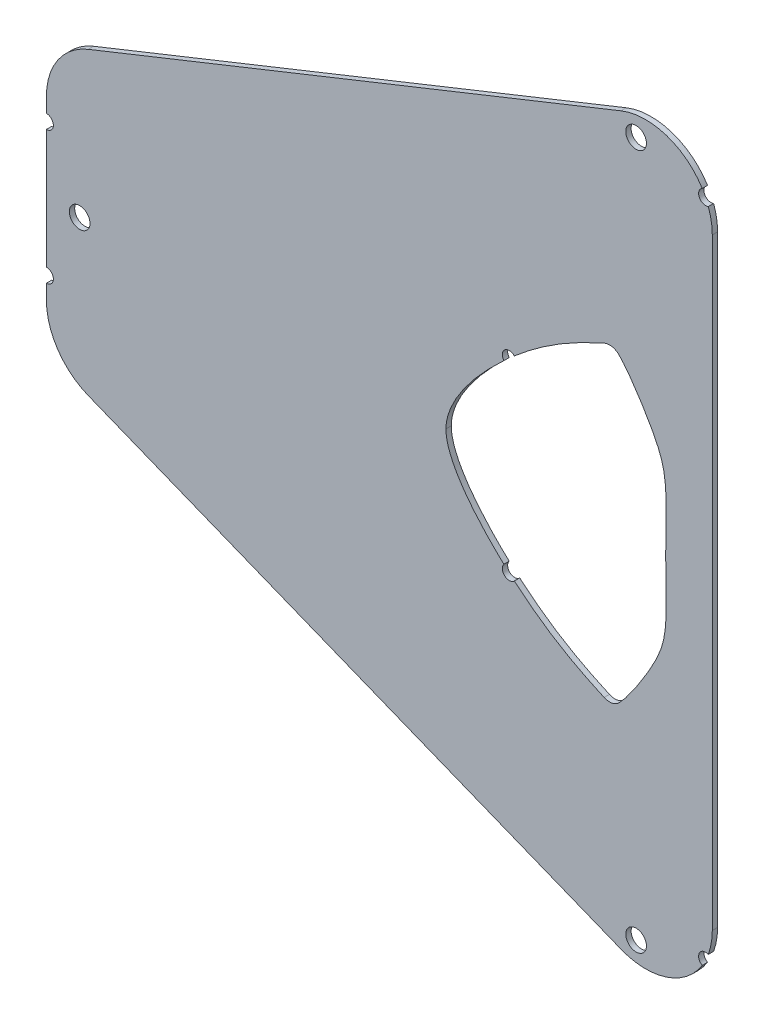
from build123d import *

# Parameters (mm, degrees)
ESQUISSE1_R      = 1.55
EXTRUSION1_DEPTH = 0.8


with BuildPart() as part:
    # Esquisse1 → Extrusion1 (new body)
    with BuildSketch(Plane.XY):
        with BuildLine():
            Line((0, 13.229670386), (0, 11.05))
            ThreePointArc((0, 11.05), (1.05, 10), (0, 8.95))
            Line((0, 8.95), (0, -8.95))
            ThreePointArc((0, -8.95), (1.05, -10), (0, -11.05))
            Line((0, -11.05), (0, -13.229670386))
            ThreePointArc((0, -13.229670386), (1.719327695, -18.835958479), (6.286093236, -22.514437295))
            Line((6.286093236, -22.514437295), (86.286093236, -54.514437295))
            ThreePointArc((86.286093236, -54.514437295), (93.113139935, -54.732741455), (98.487713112, -50.517271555))
            ThreePointArc((98.487713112, -50.517271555), (98.050844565, -49.139453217), (99.403827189, -48.630851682))
            ThreePointArc((99.403827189, -48.630851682), (99.849829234, -46.956188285), (100, -45.229670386))
            Line((100, -45.229670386), (100, -33.256005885))
            Line((100, -33.256005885), (100, 33.256005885))
            Line((100, 33.256005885), (100, 45.229670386))
            ThreePointArc((100, 45.229670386), (99.849829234, 46.956188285), (99.403827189, 48.630851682))
            ThreePointArc((99.403827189, 48.630851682), (98.050844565, 49.139453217), (98.487713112, 50.517271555))
            ThreePointArc((98.487713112, 50.517271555), (93.113139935, 54.732741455), (86.286093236, 54.514437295))
            Line((86.286093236, 54.514437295), (6.286093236, 22.514437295))
            ThreePointArc((6.286093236, 22.514437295), (1.719327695, 18.835958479), (0, 13.229670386))
        make_face()
        with Locations((5, 0)):
            Circle(ESQUISSE1_R, mode=Mode.SUBTRACT)
        with Locations((88.559040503, 52.192517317)):
            Circle(ESQUISSE1_R, mode=Mode.SUBTRACT)
        with Locations(Location((88.559040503, -52.192517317, 0), (0, 0, 180))):
            Circle(ESQUISSE1_R, mode=Mode.SUBTRACT)
        with BuildLine():
            ThreePointArc((70.275371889, 14.632479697), (68.822127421, 14.688991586), (68.706420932, 13.239258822))
            add(Edge.make_bspline(
                [(68.706420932, 13.239258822), (64.219328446, 9.108559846), (60.01836992, 3.928466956), (60, 0)],
                knots=[0.682096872, 0.682096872, 0.682096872, 0.682096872, 1, 1, 1, 1], degree=3))
            add(Edge.make_bspline(
                [(68.706420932, -13.239258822), (64.219328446, -9.108559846), (60.01836992, -3.928466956), (60, 0)],
                knots=[0.682096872, 0.682096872, 0.682096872, 0.682096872, 1, 1, 1, 1], degree=3))
            ThreePointArc((68.706420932, -13.239258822), (68.822127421, -14.688991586), (70.275371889, -14.632479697))
            add(Edge.make_bspline(
                [(83.753197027, -23.040265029), (79.438315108, -21.102683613), (75.321850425, -18.85051618), (70.663659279, -14.965115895), (70.275371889, -14.632479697)],
                knots=[0.315115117, 0.315115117, 0.315115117, 0.315115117, 0.617749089, 0.645173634, 0.645173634, 0.645173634, 0.645173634], degree=3))
            ThreePointArc((83.753197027, -23.040265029), (84.928831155, -23.183768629), (85.979500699, -22.637140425))
            add(Edge.make_bspline(
                [(92.999999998, 0), (93.143352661, -9.140205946), (93.532478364, -11.898964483), (87.354800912, -21.275722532), (85.979500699, -22.637140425)],
                knots=[0, 0, 0, 0, 0.584780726, 0.920625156, 0.920625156, 0.920625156, 0.920625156], degree=3))
            add(Edge.make_bspline(
                [(92.999999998, 0), (93.143352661, 9.140205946), (93.532478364, 11.898964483), (87.354800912, 21.275722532), (85.979500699, 22.637140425)],
                knots=[0, 0, 0, 0, 0.584780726, 0.920625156, 0.920625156, 0.920625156, 0.920625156], degree=3))
            ThreePointArc((85.979500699, 22.637140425), (84.928831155, 23.183768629), (83.753197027, 23.040265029))
            add(Edge.make_bspline(
                [(83.753197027, 23.040265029), (79.438315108, 21.102683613), (75.321850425, 18.85051618), (70.663659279, 14.965115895), (70.275371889, 14.632479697)],
                knots=[0.315115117, 0.315115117, 0.315115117, 0.315115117, 0.617749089, 0.645173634, 0.645173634, 0.645173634, 0.645173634], degree=3))
        make_face(mode=Mode.SUBTRACT)
    extrude(amount=EXTRUSION1_DEPTH)


solid = part.part
